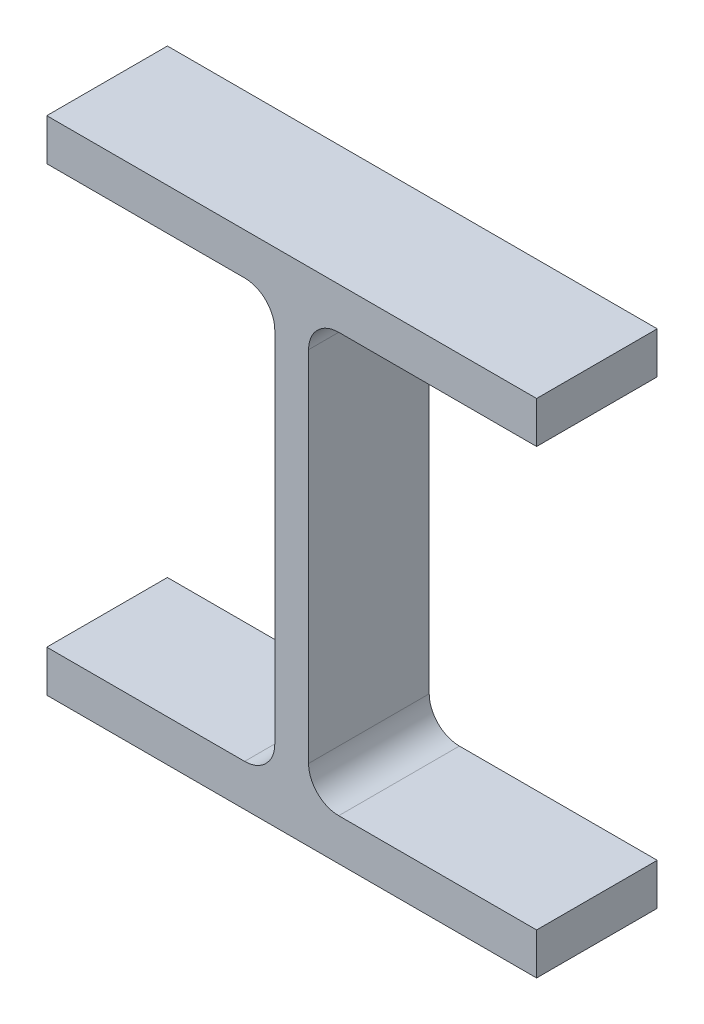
ISO-10303-21;
HEADER;
FILE_DESCRIPTION(('STEP AP214'),'2;1');
FILE_NAME('part.step','',(''),(''),'','','');
FILE_SCHEMA(('AUTOMOTIVE_DESIGN { 1 0 10303 214 1 1 1 1 }'));
ENDSEC;
DATA;
#1=APPLICATION_CONTEXT('core data for automotive mechanical design processes');
#2=APPLICATION_PROTOCOL_DEFINITION('international standard','automotive_design',2000,#1);
#3=PRODUCT_CONTEXT('',#1,'mechanical');
#4=PRODUCT('Part','Part','',(#3));
#5=PRODUCT_RELATED_PRODUCT_CATEGORY('part','',(#4));
#6=PRODUCT_DEFINITION_FORMATION('','',#4);
#7=PRODUCT_DEFINITION_CONTEXT('part definition',#1,'design');
#8=PRODUCT_DEFINITION('design','',#6,#7);
#9=PRODUCT_DEFINITION_SHAPE('','',#8);
#10=(LENGTH_UNIT() NAMED_UNIT(*) SI_UNIT(.MILLI.,.METRE.));
#11=(NAMED_UNIT(*) PLANE_ANGLE_UNIT() SI_UNIT($,.RADIAN.));
#12=(NAMED_UNIT(*) SI_UNIT($,.STERADIAN.) SOLID_ANGLE_UNIT());
#13=UNCERTAINTY_MEASURE_WITH_UNIT(LENGTH_MEASURE(1.E-05),#10,'distance_accuracy_value','');
#14=(GEOMETRIC_REPRESENTATION_CONTEXT(3) GLOBAL_UNCERTAINTY_ASSIGNED_CONTEXT((#13)) GLOBAL_UNIT_ASSIGNED_CONTEXT((#10,
#11,#12)) REPRESENTATION_CONTEXT('',''));
#15=CARTESIAN_POINT('',(0.,0.,0.));
#16=DIRECTION('',(0.,0.,1.));
#17=DIRECTION('',(1.,0.,0.));
#18=AXIS2_PLACEMENT_3D('',#15,#16,#17);
#19=CARTESIAN_POINT('',(103.12391068,0.,-12.7));
#20=DIRECTION('',(0.,-1.,0.));
#21=DIRECTION('',(1.,0.,0.));
#22=AXIS2_PLACEMENT_3D('',#19,#20,#21);
#23=PLANE('',#22);
#24=DIRECTION('',(1.,0.,0.));
#25=VECTOR('',#24,1.);
#26=CARTESIAN_POINT('',(103.12391068,0.,12.7));
#27=LINE('',#26,#25);
#28=CARTESIAN_POINT('',(0.,0.,12.7));
#29=VERTEX_POINT('',#28);
#30=CARTESIAN_POINT('',(103.12391068,0.,12.7));
#31=VERTEX_POINT('',#30);
#32=EDGE_CURVE('E177',#29,#31,#27,.T.);
#33=ORIENTED_EDGE('',*,*,#32,.F.);
#34=DIRECTION('',(0.,0.,1.));
#35=VECTOR('',#34,1.);
#36=CARTESIAN_POINT('',(0.,0.,-12.7));
#37=LINE('',#36,#35);
#38=CARTESIAN_POINT('',(0.,0.,-12.7));
#39=VERTEX_POINT('',#38);
#40=EDGE_CURVE('E11',#39,#29,#37,.T.);
#41=ORIENTED_EDGE('',*,*,#40,.F.);
#42=DIRECTION('',(1.,0.,0.));
#43=VECTOR('',#42,1.);
#44=CARTESIAN_POINT('',(103.12391068,0.,-12.7));
#45=LINE('',#44,#43);
#46=CARTESIAN_POINT('',(103.12391068,0.,-12.7));
#47=VERTEX_POINT('',#46);
#48=EDGE_CURVE('E221',#39,#47,#45,.T.);
#49=ORIENTED_EDGE('',*,*,#48,.T.);
#50=DIRECTION('',(0.,0.,1.));
#51=VECTOR('',#50,1.);
#52=CARTESIAN_POINT('',(103.12391068,0.,-12.7));
#53=LINE('',#52,#51);
#54=EDGE_CURVE('E35',#47,#31,#53,.T.);
#55=ORIENTED_EDGE('',*,*,#54,.T.);
#56=EDGE_LOOP('',(#33,#41,#49,#55));
#57=FACE_BOUND('',#56,.T.);
#58=ADVANCED_FACE('F32',(#57),#23,.T.);
#59=CARTESIAN_POINT('',(0.,0.,-12.7));
#60=DIRECTION('',(-1.,0.,0.));
#61=DIRECTION('',(0.,-1.,0.));
#62=AXIS2_PLACEMENT_3D('',#59,#60,#61);
#63=PLANE('',#62);
#64=DIRECTION('',(0.,-1.,0.));
#65=VECTOR('',#64,1.);
#66=CARTESIAN_POINT('',(0.,0.,12.7));
#67=LINE('',#66,#65);
#68=CARTESIAN_POINT('',(0.,8.76299240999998,12.7));
#69=VERTEX_POINT('',#68);
#70=EDGE_CURVE('E219',#69,#29,#67,.T.);
#71=ORIENTED_EDGE('',*,*,#70,.F.);
#72=DIRECTION('',(0.,0.,1.));
#73=VECTOR('',#72,1.);
#74=CARTESIAN_POINT('',(0.,8.76299240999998,-12.7));
#75=LINE('',#74,#73);
#76=CARTESIAN_POINT('',(0.,8.76299240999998,-12.7));
#77=VERTEX_POINT('',#76);
#78=EDGE_CURVE('E41',#77,#69,#75,.T.);
#79=ORIENTED_EDGE('',*,*,#78,.F.);
#80=DIRECTION('',(0.,-1.,0.));
#81=VECTOR('',#80,1.);
#82=CARTESIAN_POINT('',(0.,0.,-12.7));
#83=LINE('',#82,#81);
#84=EDGE_CURVE('E167',#77,#39,#83,.T.);
#85=ORIENTED_EDGE('',*,*,#84,.T.);
#86=ORIENTED_EDGE('',*,*,#40,.T.);
#87=EDGE_LOOP('',(#71,#79,#85,#86));
#88=FACE_BOUND('',#87,.T.);
#89=ADVANCED_FACE('F249',(#88),#63,.T.);
#90=CARTESIAN_POINT('',(0.,8.76299240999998,-12.7));
#91=DIRECTION('',(0.,1.,0.));
#92=DIRECTION('',(0.,0.,1.));
#93=AXIS2_PLACEMENT_3D('',#90,#91,#92);
#94=PLANE('',#93);
#95=DIRECTION('',(-1.,0.,0.));
#96=VECTOR('',#95,1.);
#97=CARTESIAN_POINT('',(0.,8.76299240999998,12.7));
#98=LINE('',#97,#96);
#99=CARTESIAN_POINT('',(41.65596392,8.76299240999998,12.7));
#100=VERTEX_POINT('',#99);
#101=EDGE_CURVE('E154',#100,#69,#98,.T.);
#102=ORIENTED_EDGE('',*,*,#101,.F.);
#103=DIRECTION('',(0.,0.,1.));
#104=VECTOR('',#103,1.);
#105=CARTESIAN_POINT('',(41.65596392,8.76299240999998,-12.7));
#106=LINE('',#105,#104);
#107=CARTESIAN_POINT('',(41.65596392,8.76299240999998,-12.7));
#108=VERTEX_POINT('',#107);
#109=EDGE_CURVE('E149',#108,#100,#106,.T.);
#110=ORIENTED_EDGE('',*,*,#109,.F.);
#111=DIRECTION('',(-1.,0.,0.));
#112=VECTOR('',#111,1.);
#113=CARTESIAN_POINT('',(0.,8.76299240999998,-12.7));
#114=LINE('',#113,#112);
#115=EDGE_CURVE('E152',#108,#77,#114,.T.);
#116=ORIENTED_EDGE('',*,*,#115,.T.);
#117=ORIENTED_EDGE('',*,*,#78,.T.);
#118=EDGE_LOOP('',(#102,#110,#116,#117));
#119=FACE_BOUND('',#118,.T.);
#120=ADVANCED_FACE('F151',(#119),#94,.T.);
#121=CARTESIAN_POINT('',(41.65596392,15.11298691,-12.7));
#122=DIRECTION('',(0.,0.,1.));
#123=DIRECTION('',(1.,0.,0.));
#124=AXIS2_PLACEMENT_3D('',#121,#122,#123);
#125=CYLINDRICAL_SURFACE('',#124,6.3499945);
#126=CARTESIAN_POINT('',(41.65596392,15.11298691,12.7));
#127=DIRECTION('',(0.,0.,-1.));
#128=DIRECTION('',(1.,0.,0.));
#129=AXIS2_PLACEMENT_3D('',#126,#127,#128);
#130=CIRCLE('',#129,6.3499945);
#131=CARTESIAN_POINT('',(48.00595842,15.11298691,12.7));
#132=VERTEX_POINT('',#131);
#133=EDGE_CURVE('E216',#132,#100,#130,.T.);
#134=ORIENTED_EDGE('',*,*,#133,.F.);
#135=DIRECTION('',(0.,0.,1.));
#136=VECTOR('',#135,1.);
#137=CARTESIAN_POINT('',(48.00595842,15.11298691,-12.7));
#138=LINE('',#137,#136);
#139=CARTESIAN_POINT('',(48.00595842,15.11298691,-12.7));
#140=VERTEX_POINT('',#139);
#141=EDGE_CURVE('E159',#140,#132,#138,.T.);
#142=ORIENTED_EDGE('',*,*,#141,.F.);
#143=CARTESIAN_POINT('',(41.65596392,15.11298691,-12.7));
#144=DIRECTION('',(0.,0.,-1.));
#145=DIRECTION('',(1.,0.,0.));
#146=AXIS2_PLACEMENT_3D('',#143,#144,#145);
#147=CIRCLE('',#146,6.3499945);
#148=EDGE_CURVE('E165',#140,#108,#147,.T.);
#149=ORIENTED_EDGE('',*,*,#148,.T.);
#150=ORIENTED_EDGE('',*,*,#109,.T.);
#151=EDGE_LOOP('',(#134,#142,#149,#150));
#152=FACE_BOUND('',#151,.T.);
#153=ADVANCED_FACE('F169',(#152),#125,.F.);
#154=CARTESIAN_POINT('',(48.00595842,15.11298691,-12.7));
#155=DIRECTION('',(-1.,0.,0.));
#156=DIRECTION('',(0.,-1.,0.));
#157=AXIS2_PLACEMENT_3D('',#154,#155,#156);
#158=PLANE('',#157);
#159=DIRECTION('',(0.,-1.,0.));
#160=VECTOR('',#159,1.);
#161=CARTESIAN_POINT('',(48.00595842,15.11298691,12.7));
#162=LINE('',#161,#160);
#163=CARTESIAN_POINT('',(48.00595842,90.55092157,12.7));
#164=VERTEX_POINT('',#163);
#165=EDGE_CURVE('E213',#164,#132,#162,.T.);
#166=ORIENTED_EDGE('',*,*,#165,.F.);
#167=DIRECTION('',(0.,0.,1.));
#168=VECTOR('',#167,1.);
#169=CARTESIAN_POINT('',(48.00595842,90.55092157,-12.7));
#170=LINE('',#169,#168);
#171=CARTESIAN_POINT('',(48.00595842,90.55092157,-12.7));
#172=VERTEX_POINT('',#171);
#173=EDGE_CURVE('E225',#172,#164,#170,.T.);
#174=ORIENTED_EDGE('',*,*,#173,.F.);
#175=DIRECTION('',(0.,-1.,0.));
#176=VECTOR('',#175,1.);
#177=CARTESIAN_POINT('',(48.00595842,15.11298691,-12.7));
#178=LINE('',#177,#176);
#179=EDGE_CURVE('E170',#172,#140,#178,.T.);
#180=ORIENTED_EDGE('',*,*,#179,.T.);
#181=ORIENTED_EDGE('',*,*,#141,.T.);
#182=EDGE_LOOP('',(#166,#174,#180,#181));
#183=FACE_BOUND('',#182,.T.);
#184=ADVANCED_FACE('F262',(#183),#158,.T.);
#185=CARTESIAN_POINT('',(41.6559639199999,90.55092157,-12.7));
#186=DIRECTION('',(0.,0.,1.));
#187=DIRECTION('',(1.,0.,0.));
#188=AXIS2_PLACEMENT_3D('',#185,#186,#187);
#189=CYLINDRICAL_SURFACE('',#188,6.3499945);
#190=CARTESIAN_POINT('',(41.6559639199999,90.55092157,12.7));
#191=DIRECTION('',(0.,0.,-1.));
#192=DIRECTION('',(1.,0.,0.));
#193=AXIS2_PLACEMENT_3D('',#190,#191,#192);
#194=CIRCLE('',#193,6.3499945);
#195=CARTESIAN_POINT('',(41.6559639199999,96.90091607,12.7));
#196=VERTEX_POINT('',#195);
#197=EDGE_CURVE('E210',#196,#164,#194,.T.);
#198=ORIENTED_EDGE('',*,*,#197,.F.);
#199=DIRECTION('',(0.,0.,1.));
#200=VECTOR('',#199,1.);
#201=CARTESIAN_POINT('',(41.6559639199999,96.90091607,-12.7));
#202=LINE('',#201,#200);
#203=CARTESIAN_POINT('',(41.6559639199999,96.90091607,-12.7));
#204=VERTEX_POINT('',#203);
#205=EDGE_CURVE('E227',#204,#196,#202,.T.);
#206=ORIENTED_EDGE('',*,*,#205,.F.);
#207=CARTESIAN_POINT('',(41.6559639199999,90.55092157,-12.7));
#208=DIRECTION('',(0.,0.,-1.));
#209=DIRECTION('',(1.,0.,0.));
#210=AXIS2_PLACEMENT_3D('',#207,#208,#209);
#211=CIRCLE('',#210,6.3499945);
#212=EDGE_CURVE('E172',#204,#172,#211,.T.);
#213=ORIENTED_EDGE('',*,*,#212,.T.);
#214=ORIENTED_EDGE('',*,*,#173,.T.);
#215=EDGE_LOOP('',(#198,#206,#213,#214));
#216=FACE_BOUND('',#215,.T.);
#217=ADVANCED_FACE('F265',(#216),#189,.F.);
#218=CARTESIAN_POINT('',(41.6559639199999,96.90091607,-12.7));
#219=DIRECTION('',(0.,-1.,0.));
#220=DIRECTION('',(0.,0.,-1.));
#221=AXIS2_PLACEMENT_3D('',#218,#219,#220);
#222=PLANE('',#221);
#223=DIRECTION('',(1.,0.,0.));
#224=VECTOR('',#223,1.);
#225=CARTESIAN_POINT('',(41.6559639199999,96.90091607,12.7));
#226=LINE('',#225,#224);
#227=CARTESIAN_POINT('',(0.,96.90091607,12.7));
#228=VERTEX_POINT('',#227);
#229=EDGE_CURVE('E207',#228,#196,#226,.T.);
#230=ORIENTED_EDGE('',*,*,#229,.F.);
#231=DIRECTION('',(0.,0.,1.));
#232=VECTOR('',#231,1.);
#233=CARTESIAN_POINT('',(0.,96.90091607,-12.7));
#234=LINE('',#233,#232);
#235=CARTESIAN_POINT('',(0.,96.90091607,-12.7));
#236=VERTEX_POINT('',#235);
#237=EDGE_CURVE('E229',#236,#228,#234,.T.);
#238=ORIENTED_EDGE('',*,*,#237,.F.);
#239=DIRECTION('',(1.,0.,0.));
#240=VECTOR('',#239,1.);
#241=CARTESIAN_POINT('',(41.6559639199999,96.90091607,-12.7));
#242=LINE('',#241,#240);
#243=EDGE_CURVE('E446',#236,#204,#242,.T.);
#244=ORIENTED_EDGE('',*,*,#243,.T.);
#245=ORIENTED_EDGE('',*,*,#205,.T.);
#246=EDGE_LOOP('',(#230,#238,#244,#245));
#247=FACE_BOUND('',#246,.T.);
#248=ADVANCED_FACE('F269',(#247),#222,.T.);
#249=CARTESIAN_POINT('',(0.,96.90091607,-12.7));
#250=DIRECTION('',(-1.,0.,0.));
#251=DIRECTION('',(0.,-1.,0.));
#252=AXIS2_PLACEMENT_3D('',#249,#250,#251);
#253=PLANE('',#252);
#254=DIRECTION('',(0.,-1.,0.));
#255=VECTOR('',#254,1.);
#256=CARTESIAN_POINT('',(0.,96.90091607,12.7));
#257=LINE('',#256,#255);
#258=CARTESIAN_POINT('',(0.,105.66390848,12.7));
#259=VERTEX_POINT('',#258);
#260=EDGE_CURVE('E204',#259,#228,#257,.T.);
#261=ORIENTED_EDGE('',*,*,#260,.F.);
#262=DIRECTION('',(0.,0.,1.));
#263=VECTOR('',#262,1.);
#264=CARTESIAN_POINT('',(0.,105.66390848,-12.7));
#265=LINE('',#264,#263);
#266=CARTESIAN_POINT('',(0.,105.66390848,-12.7));
#267=VERTEX_POINT('',#266);
#268=EDGE_CURVE('E231',#267,#259,#265,.T.);
#269=ORIENTED_EDGE('',*,*,#268,.F.);
#270=DIRECTION('',(0.,-1.,0.));
#271=VECTOR('',#270,1.);
#272=CARTESIAN_POINT('',(0.,96.90091607,-12.7));
#273=LINE('',#272,#271);
#274=EDGE_CURVE('E442',#267,#236,#273,.T.);
#275=ORIENTED_EDGE('',*,*,#274,.T.);
#276=ORIENTED_EDGE('',*,*,#237,.T.);
#277=EDGE_LOOP('',(#261,#269,#275,#276));
#278=FACE_BOUND('',#277,.T.);
#279=ADVANCED_FACE('F273',(#278),#253,.T.);
#280=CARTESIAN_POINT('',(0.,105.66390848,-12.7));
#281=DIRECTION('',(0.,1.,0.));
#282=DIRECTION('',(-1.,0.,0.));
#283=AXIS2_PLACEMENT_3D('',#280,#281,#282);
#284=PLANE('',#283);
#285=DIRECTION('',(-1.,0.,0.));
#286=VECTOR('',#285,1.);
#287=CARTESIAN_POINT('',(0.,105.66390848,12.7));
#288=LINE('',#287,#286);
#289=CARTESIAN_POINT('',(103.12391068,105.66390848,12.7));
#290=VERTEX_POINT('',#289);
#291=EDGE_CURVE('E201',#290,#259,#288,.T.);
#292=ORIENTED_EDGE('',*,*,#291,.F.);
#293=DIRECTION('',(0.,0.,1.));
#294=VECTOR('',#293,1.);
#295=CARTESIAN_POINT('',(103.12391068,105.66390848,-12.7));
#296=LINE('',#295,#294);
#297=CARTESIAN_POINT('',(103.12391068,105.66390848,-12.7));
#298=VERTEX_POINT('',#297);
#299=EDGE_CURVE('E233',#298,#290,#296,.T.);
#300=ORIENTED_EDGE('',*,*,#299,.F.);
#301=DIRECTION('',(-1.,0.,0.));
#302=VECTOR('',#301,1.);
#303=CARTESIAN_POINT('',(0.,105.66390848,-12.7));
#304=LINE('',#303,#302);
#305=EDGE_CURVE('E453',#298,#267,#304,.T.);
#306=ORIENTED_EDGE('',*,*,#305,.T.);
#307=ORIENTED_EDGE('',*,*,#268,.T.);
#308=EDGE_LOOP('',(#292,#300,#306,#307));
#309=FACE_BOUND('',#308,.T.);
#310=ADVANCED_FACE('F277',(#309),#284,.T.);
#311=CARTESIAN_POINT('',(103.12391068,105.66390848,-12.7));
#312=DIRECTION('',(1.,0.,0.));
#313=DIRECTION('',(0.,0.,-1.));
#314=AXIS2_PLACEMENT_3D('',#311,#312,#313);
#315=PLANE('',#314);
#316=DIRECTION('',(0.,1.,0.));
#317=VECTOR('',#316,1.);
#318=CARTESIAN_POINT('',(103.12391068,105.66390848,12.7));
#319=LINE('',#318,#317);
#320=CARTESIAN_POINT('',(103.12391068,96.90091607,12.7));
#321=VERTEX_POINT('',#320);
#322=EDGE_CURVE('E198',#321,#290,#319,.T.);
#323=ORIENTED_EDGE('',*,*,#322,.F.);
#324=DIRECTION('',(0.,0.,1.));
#325=VECTOR('',#324,1.);
#326=CARTESIAN_POINT('',(103.12391068,96.90091607,-12.7));
#327=LINE('',#326,#325);
#328=CARTESIAN_POINT('',(103.12391068,96.90091607,-12.7));
#329=VERTEX_POINT('',#328);
#330=EDGE_CURVE('E235',#329,#321,#327,.T.);
#331=ORIENTED_EDGE('',*,*,#330,.F.);
#332=DIRECTION('',(0.,1.,0.));
#333=VECTOR('',#332,1.);
#334=CARTESIAN_POINT('',(103.12391068,105.66390848,-12.7));
#335=LINE('',#334,#333);
#336=EDGE_CURVE('E435',#329,#298,#335,.T.);
#337=ORIENTED_EDGE('',*,*,#336,.T.);
#338=ORIENTED_EDGE('',*,*,#299,.T.);
#339=EDGE_LOOP('',(#323,#331,#337,#338));
#340=FACE_BOUND('',#339,.T.);
#341=ADVANCED_FACE('F281',(#340),#315,.T.);
#342=CARTESIAN_POINT('',(103.12391068,96.90091607,-12.7));
#343=DIRECTION('',(0.,-1.,0.));
#344=DIRECTION('',(1.,0.,0.));
#345=AXIS2_PLACEMENT_3D('',#342,#343,#344);
#346=PLANE('',#345);
#347=DIRECTION('',(1.,0.,0.));
#348=VECTOR('',#347,1.);
#349=CARTESIAN_POINT('',(103.12391068,96.90091607,12.7));
#350=LINE('',#349,#348);
#351=CARTESIAN_POINT('',(61.46794676,96.90091607,12.7));
#352=VERTEX_POINT('',#351);
#353=EDGE_CURVE('E195',#352,#321,#350,.T.);
#354=ORIENTED_EDGE('',*,*,#353,.F.);
#355=DIRECTION('',(0.,0.,1.));
#356=VECTOR('',#355,1.);
#357=CARTESIAN_POINT('',(61.46794676,96.90091607,-12.7));
#358=LINE('',#357,#356);
#359=CARTESIAN_POINT('',(61.46794676,96.90091607,-12.7));
#360=VERTEX_POINT('',#359);
#361=EDGE_CURVE('E237',#360,#352,#358,.T.);
#362=ORIENTED_EDGE('',*,*,#361,.F.);
#363=DIRECTION('',(1.,0.,0.));
#364=VECTOR('',#363,1.);
#365=CARTESIAN_POINT('',(103.12391068,96.90091607,-12.7));
#366=LINE('',#365,#364);
#367=EDGE_CURVE('E431',#360,#329,#366,.T.);
#368=ORIENTED_EDGE('',*,*,#367,.T.);
#369=ORIENTED_EDGE('',*,*,#330,.T.);
#370=EDGE_LOOP('',(#354,#362,#368,#369));
#371=FACE_BOUND('',#370,.T.);
#372=ADVANCED_FACE('F285',(#371),#346,.T.);
#373=CARTESIAN_POINT('',(61.46794676,90.55092157,-12.7));
#374=DIRECTION('',(0.,0.,1.));
#375=DIRECTION('',(1.,0.,0.));
#376=AXIS2_PLACEMENT_3D('',#373,#374,#375);
#377=CYLINDRICAL_SURFACE('',#376,6.34999449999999);
#378=CARTESIAN_POINT('',(61.46794676,90.55092157,12.7));
#379=DIRECTION('',(0.,0.,-1.));
#380=DIRECTION('',(1.,0.,0.));
#381=AXIS2_PLACEMENT_3D('',#378,#379,#380);
#382=CIRCLE('',#381,6.34999449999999);
#383=CARTESIAN_POINT('',(55.11795226,90.55092157,12.7));
#384=VERTEX_POINT('',#383);
#385=EDGE_CURVE('E192',#384,#352,#382,.T.);
#386=ORIENTED_EDGE('',*,*,#385,.F.);
#387=DIRECTION('',(0.,0.,1.));
#388=VECTOR('',#387,1.);
#389=CARTESIAN_POINT('',(55.11795226,90.55092157,-12.7));
#390=LINE('',#389,#388);
#391=CARTESIAN_POINT('',(55.11795226,90.55092157,-12.7));
#392=VERTEX_POINT('',#391);
#393=EDGE_CURVE('E239',#392,#384,#390,.T.);
#394=ORIENTED_EDGE('',*,*,#393,.F.);
#395=CARTESIAN_POINT('',(61.46794676,90.55092157,-12.7));
#396=DIRECTION('',(0.,0.,-1.));
#397=DIRECTION('',(1.,0.,0.));
#398=AXIS2_PLACEMENT_3D('',#395,#396,#397);
#399=CIRCLE('',#398,6.34999449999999);
#400=EDGE_CURVE('E457',#392,#360,#399,.T.);
#401=ORIENTED_EDGE('',*,*,#400,.T.);
#402=ORIENTED_EDGE('',*,*,#361,.T.);
#403=EDGE_LOOP('',(#386,#394,#401,#402));
#404=FACE_BOUND('',#403,.T.);
#405=ADVANCED_FACE('F289',(#404),#377,.F.);
#406=CARTESIAN_POINT('',(55.11795226,90.55092157,-12.7));
#407=DIRECTION('',(1.,0.,0.));
#408=DIRECTION('',(0.,0.,-1.));
#409=AXIS2_PLACEMENT_3D('',#406,#407,#408);
#410=PLANE('',#409);
#411=DIRECTION('',(0.,1.,0.));
#412=VECTOR('',#411,1.);
#413=CARTESIAN_POINT('',(55.11795226,90.55092157,12.7));
#414=LINE('',#413,#412);
#415=CARTESIAN_POINT('',(55.11795226,15.11298691,12.7));
#416=VERTEX_POINT('',#415);
#417=EDGE_CURVE('E189',#416,#384,#414,.T.);
#418=ORIENTED_EDGE('',*,*,#417,.F.);
#419=DIRECTION('',(0.,0.,1.));
#420=VECTOR('',#419,1.);
#421=CARTESIAN_POINT('',(55.11795226,15.11298691,-12.7));
#422=LINE('',#421,#420);
#423=CARTESIAN_POINT('',(55.11795226,15.11298691,-12.7));
#424=VERTEX_POINT('',#423);
#425=EDGE_CURVE('E241',#424,#416,#422,.T.);
#426=ORIENTED_EDGE('',*,*,#425,.F.);
#427=DIRECTION('',(0.,1.,0.));
#428=VECTOR('',#427,1.);
#429=CARTESIAN_POINT('',(55.11795226,90.55092157,-12.7));
#430=LINE('',#429,#428);
#431=EDGE_CURVE('E424',#424,#392,#430,.T.);
#432=ORIENTED_EDGE('',*,*,#431,.T.);
#433=ORIENTED_EDGE('',*,*,#393,.T.);
#434=EDGE_LOOP('',(#418,#426,#432,#433));
#435=FACE_BOUND('',#434,.T.);
#436=ADVANCED_FACE('F293',(#435),#410,.T.);
#437=CARTESIAN_POINT('',(61.46794676,15.11298691,-12.7));
#438=DIRECTION('',(0.,0.,1.));
#439=DIRECTION('',(1.,0.,0.));
#440=AXIS2_PLACEMENT_3D('',#437,#438,#439);
#441=CYLINDRICAL_SURFACE('',#440,6.3499945);
#442=CARTESIAN_POINT('',(61.46794676,15.11298691,12.7));
#443=DIRECTION('',(0.,0.,-1.));
#444=DIRECTION('',(1.,0.,0.));
#445=AXIS2_PLACEMENT_3D('',#442,#443,#444);
#446=CIRCLE('',#445,6.3499945);
#447=CARTESIAN_POINT('',(61.46794676,8.76299240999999,12.7));
#448=VERTEX_POINT('',#447);
#449=EDGE_CURVE('E186',#448,#416,#446,.T.);
#450=ORIENTED_EDGE('',*,*,#449,.F.);
#451=DIRECTION('',(0.,0.,1.));
#452=VECTOR('',#451,1.);
#453=CARTESIAN_POINT('',(61.46794676,8.76299240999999,-12.7));
#454=LINE('',#453,#452);
#455=CARTESIAN_POINT('',(61.46794676,8.76299240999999,-12.7));
#456=VERTEX_POINT('',#455);
#457=EDGE_CURVE('E243',#456,#448,#454,.T.);
#458=ORIENTED_EDGE('',*,*,#457,.F.);
#459=CARTESIAN_POINT('',(61.46794676,15.11298691,-12.7));
#460=DIRECTION('',(0.,0.,-1.));
#461=DIRECTION('',(1.,0.,0.));
#462=AXIS2_PLACEMENT_3D('',#459,#460,#461);
#463=CIRCLE('',#462,6.3499945);
#464=EDGE_CURVE('E420',#456,#424,#463,.T.);
#465=ORIENTED_EDGE('',*,*,#464,.T.);
#466=ORIENTED_EDGE('',*,*,#425,.T.);
#467=EDGE_LOOP('',(#450,#458,#465,#466));
#468=FACE_BOUND('',#467,.T.);
#469=ADVANCED_FACE('F297',(#468),#441,.F.);
#470=CARTESIAN_POINT('',(61.46794676,8.76299240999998,-12.7));
#471=DIRECTION('',(0.,1.,0.));
#472=DIRECTION('',(-1.,0.,0.));
#473=AXIS2_PLACEMENT_3D('',#470,#471,#472);
#474=PLANE('',#473);
#475=DIRECTION('',(-1.,0.,0.));
#476=VECTOR('',#475,1.);
#477=CARTESIAN_POINT('',(61.46794676,8.76299240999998,12.7));
#478=LINE('',#477,#476);
#479=CARTESIAN_POINT('',(103.12391068,8.76299240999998,12.7));
#480=VERTEX_POINT('',#479);
#481=EDGE_CURVE('E183',#480,#448,#478,.T.);
#482=ORIENTED_EDGE('',*,*,#481,.F.);
#483=DIRECTION('',(0.,0.,1.));
#484=VECTOR('',#483,1.);
#485=CARTESIAN_POINT('',(103.12391068,8.76299240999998,-12.7));
#486=LINE('',#485,#484);
#487=CARTESIAN_POINT('',(103.12391068,8.76299240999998,-12.7));
#488=VERTEX_POINT('',#487);
#489=EDGE_CURVE('E244',#488,#480,#486,.T.);
#490=ORIENTED_EDGE('',*,*,#489,.F.);
#491=DIRECTION('',(-1.,0.,0.));
#492=VECTOR('',#491,1.);
#493=CARTESIAN_POINT('',(61.46794676,8.76299240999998,-12.7));
#494=LINE('',#493,#492);
#495=EDGE_CURVE('E461',#488,#456,#494,.T.);
#496=ORIENTED_EDGE('',*,*,#495,.T.);
#497=ORIENTED_EDGE('',*,*,#457,.T.);
#498=EDGE_LOOP('',(#482,#490,#496,#497));
#499=FACE_BOUND('',#498,.T.);
#500=ADVANCED_FACE('F301',(#499),#474,.T.);
#501=CARTESIAN_POINT('',(103.12391068,8.76299240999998,-12.7));
#502=DIRECTION('',(1.,0.,0.));
#503=DIRECTION('',(0.,0.,-1.));
#504=AXIS2_PLACEMENT_3D('',#501,#502,#503);
#505=PLANE('',#504);
#506=DIRECTION('',(0.,1.,0.));
#507=VECTOR('',#506,1.);
#508=CARTESIAN_POINT('',(103.12391068,8.76299240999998,12.7));
#509=LINE('',#508,#507);
#510=EDGE_CURVE('E180',#31,#480,#509,.T.);
#511=ORIENTED_EDGE('',*,*,#510,.F.);
#512=ORIENTED_EDGE('',*,*,#54,.F.);
#513=DIRECTION('',(0.,1.,0.));
#514=VECTOR('',#513,1.);
#515=CARTESIAN_POINT('',(103.12391068,8.76299240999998,-12.7));
#516=LINE('',#515,#514);
#517=EDGE_CURVE('E463',#47,#488,#516,.T.);
#518=ORIENTED_EDGE('',*,*,#517,.T.);
#519=ORIENTED_EDGE('',*,*,#489,.T.);
#520=EDGE_LOOP('',(#511,#512,#518,#519));
#521=FACE_BOUND('',#520,.T.);
#522=ADVANCED_FACE('F246',(#521),#505,.T.);
#523=CARTESIAN_POINT('',(41.65596392,15.11298691,-12.7));
#524=DIRECTION('',(0.,0.,1.));
#525=DIRECTION('',(1.,0.,0.));
#526=AXIS2_PLACEMENT_3D('',#523,#524,#525);
#527=PLANE('',#526);
#528=ORIENTED_EDGE('',*,*,#48,.F.);
#529=ORIENTED_EDGE('',*,*,#84,.F.);
#530=ORIENTED_EDGE('',*,*,#115,.F.);
#531=ORIENTED_EDGE('',*,*,#148,.F.);
#532=ORIENTED_EDGE('',*,*,#179,.F.);
#533=ORIENTED_EDGE('',*,*,#212,.F.);
#534=ORIENTED_EDGE('',*,*,#243,.F.);
#535=ORIENTED_EDGE('',*,*,#274,.F.);
#536=ORIENTED_EDGE('',*,*,#305,.F.);
#537=ORIENTED_EDGE('',*,*,#336,.F.);
#538=ORIENTED_EDGE('',*,*,#367,.F.);
#539=ORIENTED_EDGE('',*,*,#400,.F.);
#540=ORIENTED_EDGE('',*,*,#431,.F.);
#541=ORIENTED_EDGE('',*,*,#464,.F.);
#542=ORIENTED_EDGE('',*,*,#495,.F.);
#543=ORIENTED_EDGE('',*,*,#517,.F.);
#544=EDGE_LOOP('',(#528,#529,#530,#531,#532,#533,#534,#535,#536,#537,#538,#539,#540,#541,#542,#543));
#545=FACE_BOUND('',#544,.T.);
#546=ADVANCED_FACE('F163',(#545),#527,.F.);
#547=CARTESIAN_POINT('',(41.65596392,15.11298691,12.7));
#548=DIRECTION('',(0.,0.,1.));
#549=DIRECTION('',(1.,0.,0.));
#550=AXIS2_PLACEMENT_3D('',#547,#548,#549);
#551=PLANE('',#550);
#552=ORIENTED_EDGE('',*,*,#32,.T.);
#553=ORIENTED_EDGE('',*,*,#510,.T.);
#554=ORIENTED_EDGE('',*,*,#481,.T.);
#555=ORIENTED_EDGE('',*,*,#449,.T.);
#556=ORIENTED_EDGE('',*,*,#417,.T.);
#557=ORIENTED_EDGE('',*,*,#385,.T.);
#558=ORIENTED_EDGE('',*,*,#353,.T.);
#559=ORIENTED_EDGE('',*,*,#322,.T.);
#560=ORIENTED_EDGE('',*,*,#291,.T.);
#561=ORIENTED_EDGE('',*,*,#260,.T.);
#562=ORIENTED_EDGE('',*,*,#229,.T.);
#563=ORIENTED_EDGE('',*,*,#197,.T.);
#564=ORIENTED_EDGE('',*,*,#165,.T.);
#565=ORIENTED_EDGE('',*,*,#133,.T.);
#566=ORIENTED_EDGE('',*,*,#101,.T.);
#567=ORIENTED_EDGE('',*,*,#70,.T.);
#568=EDGE_LOOP('',(#552,#553,#554,#555,#556,#557,#558,#559,#560,#561,#562,#563,#564,#565,#566,#567));
#569=FACE_BOUND('',#568,.T.);
#570=ADVANCED_FACE('F248',(#569),#551,.T.);
#571=CLOSED_SHELL('',(#58,#89,#120,#153,#184,#217,#248,#279,#310,#341,#372,#405,#436,#469,#500,
#522,#546,#570));
#572=MANIFOLD_SOLID_BREP('B2',#571);
#573=ADVANCED_BREP_SHAPE_REPRESENTATION('',(#18,#572),#14);
#574=SHAPE_DEFINITION_REPRESENTATION(#9,#573);
ENDSEC;
END-ISO-10303-21;
